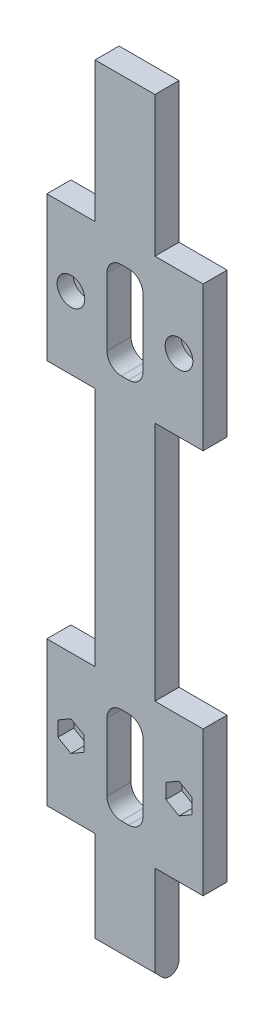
from build123d import *

# Parameters (mm, degrees)
SALIENTE_EXTRUIR1_DEPTH = 5
SALIENTE_EXTRUIR2_DEPTH = 12.431326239
CORTAR_EXTRUIR1_DEPTH   = 111.263862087
REDONDEO1_R             = 2
CROQUIS4_R              = 1.55
CORTAR_EXTRUIR2_DEPTH   = 111.172577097
CROQUIS5_R              = 2.875
CORTAR_EXTRUIR3_DEPTH   = 3.3
CROQUIS6_W              = 7.5
CROQUIS6_H              = 20
CORTAR_EXTRUIR4_DEPTH   = 111.172577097
REDONDEO2_R             = 3


with BuildPart() as part:
    # Croquis1 → Saliente-Extruir1 (new body)
    with BuildSketch(Plane.XY):
        Polygon((-11.978213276, 78.773816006), (-11.978213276, 107.842268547), (0.453112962, 107.842268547), (0.453112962, 78.773816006), (10.453112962, 78.773816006), (10.453112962, 48.773816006), (0.453112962, 48.773816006), (0.453112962, -1.226183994), (10.453112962, -1.226183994), (10.453112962, -31.226183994), (0.453112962, -31.226183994), (0.453112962, -65.086663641), (-11.978213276, -65.086663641), (-11.978213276, -31.226183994), (-21.978213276, -31.226183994), (-21.978213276, -1.226183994), (-11.978213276, -1.226183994), (-11.978213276, 48.773816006), (-21.978213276, 48.773816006), (-21.978213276, 78.773816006), align=None)
    extrude(amount=-SALIENTE_EXTRUIR1_DEPTH)

    # Croquis2 → Saliente-Extruir2 (add)
    with BuildSketch(Plane.ZY.offset(11.978213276)):
        with BuildLine():
            Line((-5, -65.086663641), (-1.464466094, -68.622197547))
            ThreePointArc((-1.464466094, -68.622197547), (-0.380602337, -67.000080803), (0, -65.086663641))
            Line((0, -65.086663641), (-5, -65.086663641))
        make_face()
    extrude(amount=-SALIENTE_EXTRUIR2_DEPTH)

    # Croquis3 → Cortar-Extruir1 (cut, through all)
    with BuildSketch(Plane.ZY.offset(11.978213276)):
        Polygon((-15, -65.086663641), (-5, -55.086663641), (0, -50.086663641), (0, -72.039676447), align=None)
    extrude(amount=-CORTAR_EXTRUIR1_DEPTH, mode=Mode.SUBTRACT)

    # Redondeo1
    redondeo1_edges = [part.edges().sort_by_distance(p)[0] for p in [
        (-5.762550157, -55.086663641, -5),
    ]]
    fillet(redondeo1_edges, radius=REDONDEO1_R)

    # Croquis4 → Cortar-Extruir2 (cut, through all)
    with BuildSketch(Plane.XY):
        with Locations((-16.978213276, -16.226183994)):
            Circle(CROQUIS4_R)
        with Locations((5.453112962, -16.226183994)):
            Circle(CROQUIS4_R)
        with Locations((5.453112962, 63.773816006)):
            Circle(CROQUIS4_R)
        with Locations((-16.978213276, 63.773816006)):
            Circle(CROQUIS4_R)
    extrude(amount=-CORTAR_EXTRUIR2_DEPTH, mode=Mode.SUBTRACT)

    # Croquis5 → Cortar-Extruir3 (cut)
    with BuildSketch(Plane.XY):
        with Locations((5.453112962, 63.773816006)):
            Circle(CROQUIS5_R)
        with Locations((-16.978213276, 63.773816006)):
            Circle(CROQUIS5_R)
        Polygon((-16.978213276, -13.106183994), (-19.680212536, -14.666183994), (-19.680212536, -17.786183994), (-16.978213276, -19.346183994), (-14.276214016, -17.786183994), (-14.276214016, -14.666183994), align=None)
        Polygon((5.453112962, -13.106183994), (2.751113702, -14.666183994), (2.751113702, -17.786183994), (5.453112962, -19.346183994), (8.155112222, -17.786183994), (8.155112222, -14.666183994), align=None)
    extrude(amount=-CORTAR_EXTRUIR3_DEPTH, mode=Mode.SUBTRACT)

    # Croquis6 → Cortar-Extruir4 (cut, through all)
    with BuildSketch(Plane.XY):
        with Locations((-5.762550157, -16.226183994)):
            Rectangle(CROQUIS6_W, CROQUIS6_H)
        with Locations((-5.762550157, 63.773816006)):
            Rectangle(CROQUIS6_W, CROQUIS6_H)
    extrude(amount=-CORTAR_EXTRUIR4_DEPTH, mode=Mode.SUBTRACT)

    # Redondeo2
    redondeo2_edges = [part.edges().sort_by_distance(p)[0] for p in [
        (-9.512550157, -26.226183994, -2.5),
        (-9.512550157, -6.226183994, -2.5),
        (-2.012550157, -6.226183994, -2.5),
        (-2.012550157, -26.226183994, -2.5),
        (-9.512550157, 53.773816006, -2.5),
        (-9.512550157, 73.773816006, -2.5),
        (-2.012550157, 73.773816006, -2.5),
        (-2.012550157, 53.773816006, -2.5),
    ]]
    fillet(redondeo2_edges, radius=REDONDEO2_R)


solid = part.part
